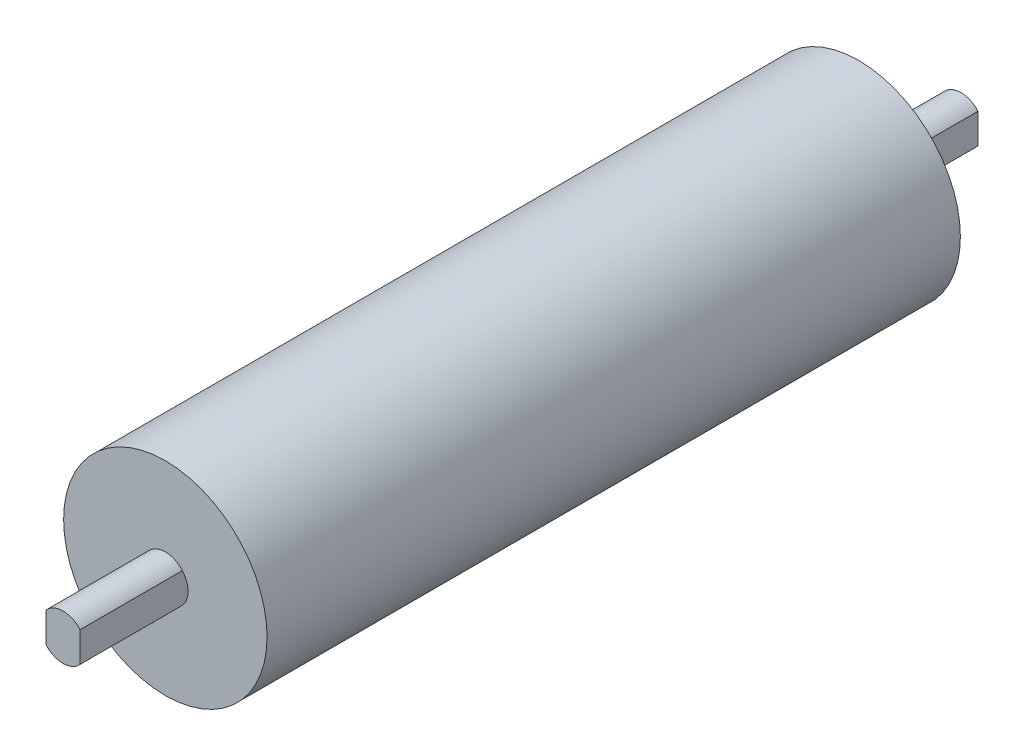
ISO-10303-21;
HEADER;
FILE_DESCRIPTION(('STEP AP214'),'2;1');
FILE_NAME('part.step','',(''),(''),'','','');
FILE_SCHEMA(('AUTOMOTIVE_DESIGN { 1 0 10303 214 1 1 1 1 }'));
ENDSEC;
DATA;
#1=APPLICATION_CONTEXT('core data for automotive mechanical design processes');
#2=APPLICATION_PROTOCOL_DEFINITION('international standard','automotive_design',2000,#1);
#3=PRODUCT_CONTEXT('',#1,'mechanical');
#4=PRODUCT('Part','Part','',(#3));
#5=PRODUCT_RELATED_PRODUCT_CATEGORY('part','',(#4));
#6=PRODUCT_DEFINITION_FORMATION('','',#4);
#7=PRODUCT_DEFINITION_CONTEXT('part definition',#1,'design');
#8=PRODUCT_DEFINITION('design','',#6,#7);
#9=PRODUCT_DEFINITION_SHAPE('','',#8);
#10=(LENGTH_UNIT() NAMED_UNIT(*) SI_UNIT(.MILLI.,.METRE.));
#11=(NAMED_UNIT(*) PLANE_ANGLE_UNIT() SI_UNIT($,.RADIAN.));
#12=(NAMED_UNIT(*) SI_UNIT($,.STERADIAN.) SOLID_ANGLE_UNIT());
#13=UNCERTAINTY_MEASURE_WITH_UNIT(LENGTH_MEASURE(1.E-05),#10,'distance_accuracy_value','');
#14=(GEOMETRIC_REPRESENTATION_CONTEXT(3) GLOBAL_UNCERTAINTY_ASSIGNED_CONTEXT((#13)) GLOBAL_UNIT_ASSIGNED_CONTEXT((#10,
#11,#12)) REPRESENTATION_CONTEXT('',''));
#15=CARTESIAN_POINT('',(0.,0.,0.));
#16=DIRECTION('',(0.,0.,1.));
#17=DIRECTION('',(1.,0.,0.));
#18=AXIS2_PLACEMENT_3D('',#15,#16,#17);
#19=CARTESIAN_POINT('',(0.,0.,152.5));
#20=DIRECTION('',(0.,0.,1.));
#21=DIRECTION('',(1.,0.,0.));
#22=AXIS2_PLACEMENT_3D('',#19,#20,#21);
#23=PLANE('',#22);
#24=CARTESIAN_POINT('',(0.,0.,152.5));
#25=DIRECTION('',(0.,0.,1.));
#26=DIRECTION('',(1.,0.,0.));
#27=AXIS2_PLACEMENT_3D('',#24,#25,#26);
#28=CIRCLE('',#27,44.75);
#29=CARTESIAN_POINT('',(44.75,0.,152.5));
#30=VERTEX_POINT('',#29);
#31=EDGE_CURVE('E11',#30,#30,#28,.T.);
#32=ORIENTED_EDGE('',*,*,#31,.T.);
#33=EDGE_LOOP('',(#32));
#34=FACE_BOUND('',#33,.T.);
#35=CARTESIAN_POINT('',(0.,0.,152.5));
#36=DIRECTION('',(0.,0.,1.));
#37=DIRECTION('',(1.,0.,0.));
#38=AXIS2_PLACEMENT_3D('',#35,#36,#37);
#39=CIRCLE('',#38,10.);
#40=CARTESIAN_POINT('',(7.5,6.61437827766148,152.5));
#41=VERTEX_POINT('',#40);
#42=CARTESIAN_POINT('',(-7.5,6.61437827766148,152.5));
#43=VERTEX_POINT('',#42);
#44=EDGE_CURVE('E148',#41,#43,#39,.T.);
#45=ORIENTED_EDGE('',*,*,#44,.F.);
#46=CARTESIAN_POINT('',(0.,0.,152.5));
#47=DIRECTION('',(0.,0.,1.));
#48=DIRECTION('',(1.,0.,0.));
#49=AXIS2_PLACEMENT_3D('',#46,#47,#48);
#50=CIRCLE('',#49,10.);
#51=CARTESIAN_POINT('',(7.5,-6.61437827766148,152.5));
#52=VERTEX_POINT('',#51);
#53=EDGE_CURVE('E116',#52,#41,#50,.T.);
#54=ORIENTED_EDGE('',*,*,#53,.F.);
#55=CARTESIAN_POINT('',(-7.5,-6.61437827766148,152.5));
#56=VERTEX_POINT('',#55);
#57=EDGE_CURVE('E150',#56,#52,#39,.T.);
#58=ORIENTED_EDGE('',*,*,#57,.F.);
#59=CARTESIAN_POINT('',(0.,0.,152.5));
#60=DIRECTION('',(0.,0.,1.));
#61=DIRECTION('',(1.,0.,0.));
#62=AXIS2_PLACEMENT_3D('',#59,#60,#61);
#63=CIRCLE('',#62,10.);
#64=EDGE_CURVE('E190',#43,#56,#63,.T.);
#65=ORIENTED_EDGE('',*,*,#64,.F.);
#66=EDGE_LOOP('',(#45,#54,#58,#65));
#67=FACE_BOUND('',#66,.T.);
#68=ADVANCED_FACE('F39',(#34,#67),#23,.T.);
#69=CARTESIAN_POINT('',(0.,0.,-197.5));
#70=DIRECTION('',(0.,0.,1.));
#71=DIRECTION('',(1.,0.,0.));
#72=AXIS2_PLACEMENT_3D('',#69,#70,#71);
#73=CYLINDRICAL_SURFACE('',#72,10.);
#74=CARTESIAN_POINT('',(0.,0.,-152.5));
#75=DIRECTION('',(0.,0.,1.));
#76=DIRECTION('',(1.,0.,0.));
#77=AXIS2_PLACEMENT_3D('',#74,#75,#76);
#78=CIRCLE('',#77,10.);
#79=CARTESIAN_POINT('',(7.5,6.61437827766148,-152.5));
#80=VERTEX_POINT('',#79);
#81=CARTESIAN_POINT('',(-7.5,6.61437827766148,-152.5));
#82=VERTEX_POINT('',#81);
#83=EDGE_CURVE('E119',#80,#82,#78,.T.);
#84=ORIENTED_EDGE('',*,*,#83,.F.);
#85=DIRECTION('',(0.,0.,-1.));
#86=VECTOR('',#85,1.);
#87=CARTESIAN_POINT('',(7.5,6.61437827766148,165.962912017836));
#88=LINE('',#87,#86);
#89=CARTESIAN_POINT('',(7.5,6.61437827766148,-197.5));
#90=VERTEX_POINT('',#89);
#91=EDGE_CURVE('E108',#80,#90,#88,.T.);
#92=ORIENTED_EDGE('',*,*,#91,.T.);
#93=CARTESIAN_POINT('',(0.,0.,-197.5));
#94=DIRECTION('',(0.,0.,1.));
#95=DIRECTION('',(1.,0.,0.));
#96=AXIS2_PLACEMENT_3D('',#93,#94,#95);
#97=CIRCLE('',#96,10.);
#98=CARTESIAN_POINT('',(-7.5,6.61437827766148,-197.5));
#99=VERTEX_POINT('',#98);
#100=EDGE_CURVE('E62',#90,#99,#97,.T.);
#101=ORIENTED_EDGE('',*,*,#100,.T.);
#102=DIRECTION('',(0.,0.,-1.));
#103=VECTOR('',#102,1.);
#104=CARTESIAN_POINT('',(-7.5,6.61437827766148,165.962912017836));
#105=LINE('',#104,#103);
#106=EDGE_CURVE('E213',#82,#99,#105,.T.);
#107=ORIENTED_EDGE('',*,*,#106,.F.);
#108=EDGE_LOOP('',(#84,#92,#101,#107));
#109=FACE_BOUND('',#108,.T.);
#110=ADVANCED_FACE('F118',(#109),#73,.T.);
#111=CARTESIAN_POINT('',(-7.5,-6.61437827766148,-197.5));
#112=VERTEX_POINT('',#111);
#113=CARTESIAN_POINT('',(7.5,-6.61437827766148,-197.5));
#114=VERTEX_POINT('',#113);
#115=EDGE_CURVE('E126',#112,#114,#97,.T.);
#116=ORIENTED_EDGE('',*,*,#115,.T.);
#117=DIRECTION('',(0.,0.,-1.));
#118=VECTOR('',#117,1.);
#119=CARTESIAN_POINT('',(7.5,-6.61437827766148,165.962912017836));
#120=LINE('',#119,#118);
#121=CARTESIAN_POINT('',(7.5,-6.61437827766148,-152.5));
#122=VERTEX_POINT('',#121);
#123=EDGE_CURVE('E112',#122,#114,#120,.T.);
#124=ORIENTED_EDGE('',*,*,#123,.F.);
#125=CARTESIAN_POINT('',(-7.5,-6.61437827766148,-152.5));
#126=VERTEX_POINT('',#125);
#127=EDGE_CURVE('E131',#126,#122,#78,.T.);
#128=ORIENTED_EDGE('',*,*,#127,.F.);
#129=DIRECTION('',(0.,0.,-1.));
#130=VECTOR('',#129,1.);
#131=CARTESIAN_POINT('',(-7.5,-6.61437827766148,165.962912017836));
#132=LINE('',#131,#130);
#133=EDGE_CURVE('E212',#126,#112,#132,.T.);
#134=ORIENTED_EDGE('',*,*,#133,.T.);
#135=EDGE_LOOP('',(#116,#124,#128,#134));
#136=FACE_BOUND('',#135,.T.);
#137=ADVANCED_FACE('F181',(#136),#73,.T.);
#138=CARTESIAN_POINT('',(0.,0.,-197.5));
#139=DIRECTION('',(0.,0.,-1.));
#140=DIRECTION('',(1.,0.,0.));
#141=AXIS2_PLACEMENT_3D('',#138,#139,#140);
#142=PLANE('',#141);
#143=ORIENTED_EDGE('',*,*,#100,.F.);
#144=DIRECTION('',(0.,-1.,0.));
#145=VECTOR('',#144,1.);
#146=CARTESIAN_POINT('',(7.5,6.61437827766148,-197.5));
#147=LINE('',#146,#145);
#148=EDGE_CURVE('E105',#90,#114,#147,.T.);
#149=ORIENTED_EDGE('',*,*,#148,.T.);
#150=ORIENTED_EDGE('',*,*,#115,.F.);
#151=DIRECTION('',(0.,1.,0.));
#152=VECTOR('',#151,1.);
#153=CARTESIAN_POINT('',(-7.5,6.61437827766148,-197.5));
#154=LINE('',#153,#152);
#155=EDGE_CURVE('E125',#112,#99,#154,.T.);
#156=ORIENTED_EDGE('',*,*,#155,.T.);
#157=EDGE_LOOP('',(#143,#149,#150,#156));
#158=FACE_BOUND('',#157,.T.);
#159=ADVANCED_FACE('F124',(#158),#142,.T.);
#160=CARTESIAN_POINT('',(0.,0.,197.5));
#161=DIRECTION('',(0.,0.,-1.));
#162=DIRECTION('',(-1.,0.,0.));
#163=AXIS2_PLACEMENT_3D('',#160,#161,#162);
#164=CYLINDRICAL_SURFACE('',#163,10.);
#165=CARTESIAN_POINT('',(0.,0.,197.5));
#166=DIRECTION('',(0.,0.,1.));
#167=DIRECTION('',(1.,0.,0.));
#168=AXIS2_PLACEMENT_3D('',#165,#166,#167);
#169=CIRCLE('',#168,10.);
#170=CARTESIAN_POINT('',(7.5,6.61437827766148,197.5));
#171=VERTEX_POINT('',#170);
#172=CARTESIAN_POINT('',(-7.5,6.61437827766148,197.5));
#173=VERTEX_POINT('',#172);
#174=EDGE_CURVE('E153',#171,#173,#169,.T.);
#175=ORIENTED_EDGE('',*,*,#174,.F.);
#176=DIRECTION('',(0.,0.,1.));
#177=VECTOR('',#176,1.);
#178=CARTESIAN_POINT('',(7.5,6.61437827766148,139.037087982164));
#179=LINE('',#178,#177);
#180=EDGE_CURVE('E136',#41,#171,#179,.T.);
#181=ORIENTED_EDGE('',*,*,#180,.F.);
#182=ORIENTED_EDGE('',*,*,#44,.T.);
#183=DIRECTION('',(0.,0.,1.));
#184=VECTOR('',#183,1.);
#185=CARTESIAN_POINT('',(-7.5,6.61437827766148,139.037087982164));
#186=LINE('',#185,#184);
#187=EDGE_CURVE('E145',#43,#173,#186,.T.);
#188=ORIENTED_EDGE('',*,*,#187,.T.);
#189=EDGE_LOOP('',(#175,#181,#182,#188));
#190=FACE_BOUND('',#189,.T.);
#191=ADVANCED_FACE('F172',(#190),#164,.T.);
#192=CARTESIAN_POINT('',(0.,0.,152.5));
#193=DIRECTION('',(0.,0.,-1.));
#194=DIRECTION('',(-1.,0.,0.));
#195=AXIS2_PLACEMENT_3D('',#192,#193,#194);
#196=CYLINDRICAL_SURFACE('',#195,44.75);
#197=ORIENTED_EDGE('',*,*,#31,.F.);
#198=EDGE_LOOP('',(#197));
#199=FACE_BOUND('',#198,.T.);
#200=CARTESIAN_POINT('',(0.,0.,-152.5));
#201=DIRECTION('',(0.,0.,1.));
#202=DIRECTION('',(1.,0.,0.));
#203=AXIS2_PLACEMENT_3D('',#200,#201,#202);
#204=CIRCLE('',#203,44.75);
#205=CARTESIAN_POINT('',(44.75,0.,-152.5));
#206=VERTEX_POINT('',#205);
#207=EDGE_CURVE('E47',#206,#206,#204,.T.);
#208=ORIENTED_EDGE('',*,*,#207,.T.);
#209=EDGE_LOOP('',(#208));
#210=FACE_BOUND('',#209,.T.);
#211=ADVANCED_FACE('F41',(#199,#210),#196,.T.);
#212=CARTESIAN_POINT('',(0.,0.,-152.5));
#213=DIRECTION('',(0.,0.,1.));
#214=DIRECTION('',(1.,0.,0.));
#215=AXIS2_PLACEMENT_3D('',#212,#213,#214);
#216=PLANE('',#215);
#217=EDGE_CURVE('E127',#82,#126,#78,.T.);
#218=ORIENTED_EDGE('',*,*,#217,.T.);
#219=ORIENTED_EDGE('',*,*,#127,.T.);
#220=EDGE_CURVE('E216',#122,#80,#78,.T.);
#221=ORIENTED_EDGE('',*,*,#220,.T.);
#222=ORIENTED_EDGE('',*,*,#83,.T.);
#223=EDGE_LOOP('',(#218,#219,#221,#222));
#224=FACE_BOUND('',#223,.T.);
#225=ORIENTED_EDGE('',*,*,#207,.F.);
#226=EDGE_LOOP('',(#225));
#227=FACE_BOUND('',#226,.T.);
#228=ADVANCED_FACE('F160',(#224,#227),#216,.F.);
#229=ORIENTED_EDGE('',*,*,#57,.T.);
#230=DIRECTION('',(0.,0.,1.));
#231=VECTOR('',#230,1.);
#232=CARTESIAN_POINT('',(7.5,-6.61437827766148,139.037087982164));
#233=LINE('',#232,#231);
#234=CARTESIAN_POINT('',(7.5,-6.61437827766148,197.5));
#235=VERTEX_POINT('',#234);
#236=EDGE_CURVE('E137',#52,#235,#233,.T.);
#237=ORIENTED_EDGE('',*,*,#236,.T.);
#238=CARTESIAN_POINT('',(-7.5,-6.61437827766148,197.5));
#239=VERTEX_POINT('',#238);
#240=EDGE_CURVE('E154',#239,#235,#169,.T.);
#241=ORIENTED_EDGE('',*,*,#240,.F.);
#242=DIRECTION('',(0.,0.,1.));
#243=VECTOR('',#242,1.);
#244=CARTESIAN_POINT('',(-7.5,-6.61437827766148,139.037087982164));
#245=LINE('',#244,#243);
#246=EDGE_CURVE('E144',#56,#239,#245,.T.);
#247=ORIENTED_EDGE('',*,*,#246,.F.);
#248=EDGE_LOOP('',(#229,#237,#241,#247));
#249=FACE_BOUND('',#248,.T.);
#250=ADVANCED_FACE('F162',(#249),#164,.T.);
#251=CARTESIAN_POINT('',(0.,0.,197.5));
#252=DIRECTION('',(0.,0.,1.));
#253=DIRECTION('',(1.,0.,0.));
#254=AXIS2_PLACEMENT_3D('',#251,#252,#253);
#255=PLANE('',#254);
#256=DIRECTION('',(0.,-1.,0.));
#257=VECTOR('',#256,1.);
#258=CARTESIAN_POINT('',(7.5,6.61437827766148,197.5));
#259=LINE('',#258,#257);
#260=EDGE_CURVE('E129',#171,#235,#259,.T.);
#261=ORIENTED_EDGE('',*,*,#260,.F.);
#262=ORIENTED_EDGE('',*,*,#174,.T.);
#263=DIRECTION('',(0.,1.,0.));
#264=VECTOR('',#263,1.);
#265=CARTESIAN_POINT('',(-7.5,6.61437827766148,197.5));
#266=LINE('',#265,#264);
#267=EDGE_CURVE('E140',#239,#173,#266,.T.);
#268=ORIENTED_EDGE('',*,*,#267,.F.);
#269=ORIENTED_EDGE('',*,*,#240,.T.);
#270=EDGE_LOOP('',(#261,#262,#268,#269));
#271=FACE_BOUND('',#270,.T.);
#272=ADVANCED_FACE('F169',(#271),#255,.T.);
#273=CARTESIAN_POINT('',(-7.5,6.61437827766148,139.037087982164));
#274=DIRECTION('',(1.,0.,0.));
#275=DIRECTION('',(0.,0.,-1.));
#276=AXIS2_PLACEMENT_3D('',#273,#274,#275);
#277=PLANE('',#276);
#278=ORIENTED_EDGE('',*,*,#187,.F.);
#279=EDGE_CURVE('E198',#43,#82,#105,.T.);
#280=ORIENTED_EDGE('',*,*,#279,.T.);
#281=ORIENTED_EDGE('',*,*,#106,.T.);
#282=ORIENTED_EDGE('',*,*,#155,.F.);
#283=ORIENTED_EDGE('',*,*,#133,.F.);
#284=EDGE_CURVE('E209',#56,#126,#132,.T.);
#285=ORIENTED_EDGE('',*,*,#284,.F.);
#286=ORIENTED_EDGE('',*,*,#246,.T.);
#287=ORIENTED_EDGE('',*,*,#267,.T.);
#288=EDGE_LOOP('',(#278,#280,#281,#282,#283,#285,#286,#287));
#289=FACE_BOUND('',#288,.T.);
#290=ADVANCED_FACE('F197',(#289),#277,.F.);
#291=CARTESIAN_POINT('',(7.5,6.61437827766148,139.037087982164));
#292=DIRECTION('',(-1.,0.,0.));
#293=DIRECTION('',(0.,0.,1.));
#294=AXIS2_PLACEMENT_3D('',#291,#292,#293);
#295=PLANE('',#294);
#296=ORIENTED_EDGE('',*,*,#236,.F.);
#297=EDGE_CURVE('E121',#52,#122,#120,.T.);
#298=ORIENTED_EDGE('',*,*,#297,.T.);
#299=ORIENTED_EDGE('',*,*,#123,.T.);
#300=ORIENTED_EDGE('',*,*,#148,.F.);
#301=ORIENTED_EDGE('',*,*,#91,.F.);
#302=EDGE_CURVE('E54',#41,#80,#88,.T.);
#303=ORIENTED_EDGE('',*,*,#302,.F.);
#304=ORIENTED_EDGE('',*,*,#180,.T.);
#305=ORIENTED_EDGE('',*,*,#260,.T.);
#306=EDGE_LOOP('',(#296,#298,#299,#300,#301,#303,#304,#305));
#307=FACE_BOUND('',#306,.T.);
#308=ADVANCED_FACE('F107',(#307),#295,.F.);
#309=CARTESIAN_POINT('',(0.,0.,165.962912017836));
#310=DIRECTION('',(0.,0.,-1.));
#311=DIRECTION('',(-1.,0.,0.));
#312=AXIS2_PLACEMENT_3D('',#309,#310,#311);
#313=CYLINDRICAL_SURFACE('',#312,10.);
#314=ORIENTED_EDGE('',*,*,#217,.F.);
#315=ORIENTED_EDGE('',*,*,#279,.F.);
#316=ORIENTED_EDGE('',*,*,#64,.T.);
#317=ORIENTED_EDGE('',*,*,#284,.T.);
#318=EDGE_LOOP('',(#314,#315,#316,#317));
#319=FACE_BOUND('',#318,.T.);
#320=ADVANCED_FACE('F220',(#319),#313,.F.);
#321=CARTESIAN_POINT('',(0.,0.,165.962912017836));
#322=DIRECTION('',(0.,0.,-1.));
#323=DIRECTION('',(-1.,0.,0.));
#324=AXIS2_PLACEMENT_3D('',#321,#322,#323);
#325=CYLINDRICAL_SURFACE('',#324,10.);
#326=ORIENTED_EDGE('',*,*,#220,.F.);
#327=ORIENTED_EDGE('',*,*,#297,.F.);
#328=ORIENTED_EDGE('',*,*,#53,.T.);
#329=ORIENTED_EDGE('',*,*,#302,.T.);
#330=EDGE_LOOP('',(#326,#327,#328,#329));
#331=FACE_BOUND('',#330,.T.);
#332=ADVANCED_FACE('F215',(#331),#325,.F.);
#333=CLOSED_SHELL('',(#68,#110,#137,#159,#191,#211,#228,#250,#272,#290,#308,#320,#332));
#334=MANIFOLD_SOLID_BREP('B2',#333);
#335=ADVANCED_BREP_SHAPE_REPRESENTATION('',(#18,#334),#14);
#336=SHAPE_DEFINITION_REPRESENTATION(#9,#335);
ENDSEC;
END-ISO-10303-21;
